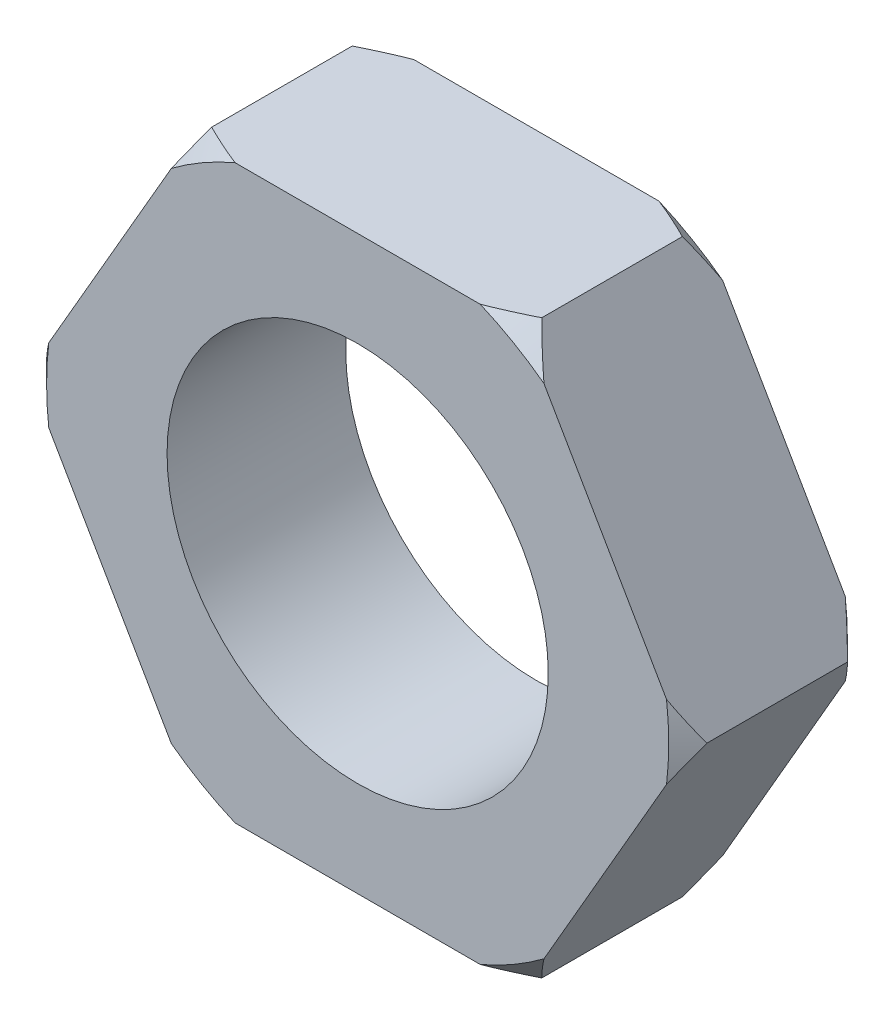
ISO-10303-21;
HEADER;
FILE_DESCRIPTION(('STEP AP214'),'2;1');
FILE_NAME('part.step','',(''),(''),'','','');
FILE_SCHEMA(('AUTOMOTIVE_DESIGN { 1 0 10303 214 1 1 1 1 }'));
ENDSEC;
DATA;
#1=APPLICATION_CONTEXT('core data for automotive mechanical design processes');
#2=APPLICATION_PROTOCOL_DEFINITION('international standard','automotive_design',2000,#1);
#3=PRODUCT_CONTEXT('',#1,'mechanical');
#4=PRODUCT('Part','Part','',(#3));
#5=PRODUCT_RELATED_PRODUCT_CATEGORY('part','',(#4));
#6=PRODUCT_DEFINITION_FORMATION('','',#4);
#7=PRODUCT_DEFINITION_CONTEXT('part definition',#1,'design');
#8=PRODUCT_DEFINITION('design','',#6,#7);
#9=PRODUCT_DEFINITION_SHAPE('','',#8);
#10=(LENGTH_UNIT() NAMED_UNIT(*) SI_UNIT(.MILLI.,.METRE.));
#11=(NAMED_UNIT(*) PLANE_ANGLE_UNIT() SI_UNIT($,.RADIAN.));
#12=(NAMED_UNIT(*) SI_UNIT($,.STERADIAN.) SOLID_ANGLE_UNIT());
#13=UNCERTAINTY_MEASURE_WITH_UNIT(LENGTH_MEASURE(1.E-05),#10,'distance_accuracy_value','');
#14=(GEOMETRIC_REPRESENTATION_CONTEXT(3) GLOBAL_UNCERTAINTY_ASSIGNED_CONTEXT((#13)) GLOBAL_UNIT_ASSIGNED_CONTEXT((#10,
#11,#12)) REPRESENTATION_CONTEXT('',''));
#15=CARTESIAN_POINT('',(0.,0.,0.));
#16=DIRECTION('',(0.,0.,1.));
#17=DIRECTION('',(1.,0.,0.));
#18=AXIS2_PLACEMENT_3D('',#15,#16,#17);
#19=CARTESIAN_POINT('',(6.92820323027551,12.,-7.5));
#20=DIRECTION('',(0.,1.,0.));
#21=DIRECTION('',(0.,0.,1.));
#22=AXIS2_PLACEMENT_3D('',#19,#20,#21);
#23=PLANE('',#22);
#24=CARTESIAN_POINT('',(-0.329616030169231,12.,1.05188036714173));
#25=CARTESIAN_POINT('',(-0.517661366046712,12.,1.04673909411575));
#26=CARTESIAN_POINT('',(-0.705573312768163,12.,1.0371428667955));
#27=CARTESIAN_POINT('',(-1.08071792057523,12.,1.0092861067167));
#28=CARTESIAN_POINT('',(-1.26795070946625,12.,0.99102729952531));
#29=CARTESIAN_POINT('',(-1.64111367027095,12.,0.946123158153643));
#30=CARTESIAN_POINT('',(-1.82704539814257,12.,0.919490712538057));
#31=CARTESIAN_POINT('',(-2.19757769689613,12.,0.858211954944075));
#32=CARTESIAN_POINT('',(-2.3821782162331,12.,0.823565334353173));
#33=CARTESIAN_POINT('',(-2.92963006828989,12.,0.70908273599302));
#34=CARTESIAN_POINT('',(-3.29020675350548,12.,0.618195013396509));
#35=CARTESIAN_POINT('',(-4.00377556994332,12.,0.410715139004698));
#36=CARTESIAN_POINT('',(-4.35676765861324,12.,0.294122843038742));
#37=CARTESIAN_POINT('',(-4.8098025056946,12.,0.128730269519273));
#38=CARTESIAN_POINT('',(-4.91352664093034,12.,0.0897707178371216));
#39=CARTESIAN_POINT('',(-5.12037499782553,12.,0.00998428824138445));
#40=CARTESIAN_POINT('',(-5.22349851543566,12.,-0.0308444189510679));
#41=CARTESIAN_POINT('',(-5.76598504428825,12.,-0.250920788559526));
#42=CARTESIAN_POINT('',(-6.19933830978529,12.,-0.445147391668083));
#43=CARTESIAN_POINT('',(-7.0541536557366,12.,-0.858367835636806));
#44=CARTESIAN_POINT('',(-7.47560879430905,12.,-1.07737577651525));
#45=CARTESIAN_POINT('',(-8.30917616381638,12.,-1.53539981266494));
#46=CARTESIAN_POINT('',(-8.72125467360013,12.,-1.77447692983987));
#47=CARTESIAN_POINT('',(-9.53605768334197,12.,-2.26780017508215));
#48=CARTESIAN_POINT('',(-9.93878397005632,12.,-2.52204337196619));
#49=CARTESIAN_POINT('',(-10.7308448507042,12.,-3.03900575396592));
#50=CARTESIAN_POINT('',(-11.1202874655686,12.,-3.30156015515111));
#51=CARTESIAN_POINT('',(-11.8926572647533,12.,-3.83612504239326));
#52=CARTESIAN_POINT('',(-12.2755838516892,12.,-4.10813638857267));
#53=CARTESIAN_POINT('',(-13.0328997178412,12.,-4.65768793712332));
#54=CARTESIAN_POINT('',(-13.4073322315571,12.,-4.93516869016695));
#55=CARTESIAN_POINT('',(-13.9653999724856,12.,-5.35602175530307));
#56=CARTESIAN_POINT('',(-14.150802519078,12.,-5.49705999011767));
#57=CARTESIAN_POINT('',(-14.5205127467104,12.,-5.78055793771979));
#58=CARTESIAN_POINT('',(-14.7048204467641,12.,-5.92301762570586));
#59=CARTESIAN_POINT('',(-14.8886252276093,12.,-6.06612373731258));
#60=B_SPLINE_CURVE_WITH_KNOTS('',3,(#24,#25,#26,#27,#28,#29,#30,#31,#32,#33,#34,#35,#36,#37,#38,
#39,#40,#41,#42,#43,#44,#45,#46,#47,#48,#49,#50,#51,#52,#53,#54,#55,#56,#57,#58,#59),
.UNSPECIFIED.,.F.,.F.,(4,2,2,2,2,2,2,2,2,2,2,2,2,2,2,2,2,4),(0.,0.564276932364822,
1.12844150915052,1.69174194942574,2.25506408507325,3.36942770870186,4.48379758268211,
4.81618698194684,5.14890894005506,6.57240245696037,7.99671002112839,9.4255171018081,
10.8540489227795,12.2629226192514,13.6719247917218,15.0699691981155,15.7688148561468,
16.4676483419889),.UNSPECIFIED.);
#61=CARTESIAN_POINT('',(-5.14487605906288,12.,0.));
#62=VERTEX_POINT('',#61);
#63=CARTESIAN_POINT('',(-6.92820323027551,12.,-0.8));
#64=VERTEX_POINT('',#63);
#65=EDGE_CURVE('E158',#62,#64,#60,.T.);
#66=ORIENTED_EDGE('',*,*,#65,.F.);
#67=DIRECTION('',(-1.,0.,0.));
#68=VECTOR('',#67,1.);
#69=CARTESIAN_POINT('',(6.92820323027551,12.,0.));
#70=LINE('',#69,#68);
#71=CARTESIAN_POINT('',(5.14487605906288,12.,0.));
#72=VERTEX_POINT('',#71);
#73=EDGE_CURVE('E370',#72,#62,#70,.T.);
#74=ORIENTED_EDGE('',*,*,#73,.F.);
#75=CARTESIAN_POINT('',(14.8886252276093,12.,-6.06612373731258));
#76=CARTESIAN_POINT('',(14.6996404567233,12.,-5.91898482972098));
#77=CARTESIAN_POINT('',(14.5101241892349,12.,-5.77252909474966));
#78=CARTESIAN_POINT('',(14.1299314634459,12.,-5.48112407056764));
#79=CARTESIAN_POINT('',(13.9392549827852,12.,-5.33617481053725));
#80=CARTESIAN_POINT('',(13.3652432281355,12.,-4.90372465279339));
#81=CARTESIAN_POINT('',(12.9800314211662,12.,-4.61870397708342));
#82=CARTESIAN_POINT('',(12.2007600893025,12.,-4.0545759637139));
#83=CARTESIAN_POINT('',(11.8066552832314,12.,-3.77553103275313));
#84=CARTESIAN_POINT('',(11.0114659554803,12.,-3.22761378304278));
#85=CARTESIAN_POINT('',(10.6103821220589,12.,-2.95874046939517));
#86=CARTESIAN_POINT('',(9.81666071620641,12.,-2.44453643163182));
#87=CARTESIAN_POINT('',(9.42435726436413,12.,-2.19869207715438));
#88=CARTESIAN_POINT('',(8.63082004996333,12.,-1.72163382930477));
#89=CARTESIAN_POINT('',(8.22958495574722,12.,-1.49042213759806));
#90=CARTESIAN_POINT('',(7.41797649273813,12.,-1.04717817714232));
#91=CARTESIAN_POINT('',(7.00763040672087,12.,-0.835096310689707));
#92=CARTESIAN_POINT('',(6.17564968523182,12.,-0.434546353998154));
#93=CARTESIAN_POINT('',(5.75401986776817,12.,-0.246068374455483));
#94=CARTESIAN_POINT('',(4.93227158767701,12.,0.0873022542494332));
#95=CARTESIAN_POINT('',(4.53307986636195,12.,0.234460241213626));
#96=CARTESIAN_POINT('',(3.72459547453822,12.,0.497470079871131));
#97=CARTESIAN_POINT('',(3.31531017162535,12.,0.613344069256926));
#98=CARTESIAN_POINT('',(2.6912050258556,12.,0.760039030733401));
#99=CARTESIAN_POINT('',(2.47958658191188,12.,0.804684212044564));
#100=CARTESIAN_POINT('',(2.05442145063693,12.,0.883607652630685));
#101=CARTESIAN_POINT('',(1.84087491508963,12.,0.917886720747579));
#102=CARTESIAN_POINT('',(1.41158076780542,12.,0.975544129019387));
#103=CARTESIAN_POINT('',(1.19582818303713,12.,0.998885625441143));
#104=CARTESIAN_POINT('',(0.763317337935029,12.,1.03409650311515));
#105=CARTESIAN_POINT('',(0.546558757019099,12.,1.04596193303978));
#106=CARTESIAN_POINT('',(0.329616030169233,12.,1.05188036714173));
#107=B_SPLINE_CURVE_WITH_KNOTS('',3,(#75,#76,#77,#78,#79,#80,#81,#82,#83,#84,#85,#86,#87,#88,
#89,#90,#91,#92,#93,#94,#95,#96,#97,#98,#99,#100,#101,#102,#103,#104,#105,#106),.UNSPECIFIED.,
.F.,.F.,(4,2,2,2,2,2,2,2,2,2,2,2,2,2,2,4),(0.,0.718527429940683,1.43706875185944,
2.87455397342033,4.32310435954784,5.77151269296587,7.16017067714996,8.54903710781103,
9.93419240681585,11.31876541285,12.5941185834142,13.8685668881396,14.5171810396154,
15.1657445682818,15.8164773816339,16.4674341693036),.UNSPECIFIED.);
#108=CARTESIAN_POINT('',(6.92820323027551,12.,-0.8));
#109=VERTEX_POINT('',#108);
#110=EDGE_CURVE('E334',#109,#72,#107,.T.);
#111=ORIENTED_EDGE('',*,*,#110,.F.);
#112=DIRECTION('',(0.,0.,1.));
#113=VECTOR('',#112,1.);
#114=CARTESIAN_POINT('',(6.92820323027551,12.,-7.5));
#115=LINE('',#114,#113);
#116=CARTESIAN_POINT('',(6.92820323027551,12.,-6.7));
#117=VERTEX_POINT('',#116);
#118=EDGE_CURVE('E188',#117,#109,#115,.T.);
#119=ORIENTED_EDGE('',*,*,#118,.F.);
#120=CARTESIAN_POINT('',(0.329616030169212,12.,-8.55188036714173));
#121=CARTESIAN_POINT('',(0.517661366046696,12.,-8.54673909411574));
#122=CARTESIAN_POINT('',(0.705573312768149,12.,-8.53714286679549));
#123=CARTESIAN_POINT('',(1.08071792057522,12.,-8.5092861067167));
#124=CARTESIAN_POINT('',(1.26795070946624,12.,-8.4910272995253));
#125=CARTESIAN_POINT('',(1.64111367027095,12.,-8.44612315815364));
#126=CARTESIAN_POINT('',(1.82704539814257,12.,-8.41949071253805));
#127=CARTESIAN_POINT('',(2.19757769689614,12.,-8.35821195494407));
#128=CARTESIAN_POINT('',(2.38217821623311,12.,-8.32356533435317));
#129=CARTESIAN_POINT('',(2.92963006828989,12.,-8.20908273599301));
#130=CARTESIAN_POINT('',(3.29020675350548,12.,-8.11819501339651));
#131=CARTESIAN_POINT('',(4.00377556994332,12.,-7.9107151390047));
#132=CARTESIAN_POINT('',(4.35676765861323,12.,-7.79412284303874));
#133=CARTESIAN_POINT('',(4.80980250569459,12.,-7.62873026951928));
#134=CARTESIAN_POINT('',(4.91352664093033,12.,-7.58977071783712));
#135=CARTESIAN_POINT('',(5.12037499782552,12.,-7.50998428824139));
#136=CARTESIAN_POINT('',(5.22349851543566,12.,-7.46915558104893));
#137=CARTESIAN_POINT('',(5.76598504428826,12.,-7.24907921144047));
#138=CARTESIAN_POINT('',(6.19933830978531,12.,-7.05485260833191));
#139=CARTESIAN_POINT('',(7.05415365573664,12.,-6.64163216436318));
#140=CARTESIAN_POINT('',(7.4756087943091,12.,-6.42262422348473));
#141=CARTESIAN_POINT('',(8.30917616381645,12.,-5.96460018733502));
#142=CARTESIAN_POINT('',(8.72125467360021,12.,-5.72552307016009));
#143=CARTESIAN_POINT('',(9.53605768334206,12.,-5.2321998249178));
#144=CARTESIAN_POINT('',(9.93878397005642,12.,-4.97795662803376));
#145=CARTESIAN_POINT('',(10.7308448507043,12.,-4.46099424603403));
#146=CARTESIAN_POINT('',(11.1202874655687,12.,-4.19843984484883));
#147=CARTESIAN_POINT('',(11.8926572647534,12.,-3.6638749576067));
#148=CARTESIAN_POINT('',(12.2755838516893,12.,-3.3918636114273));
#149=CARTESIAN_POINT('',(13.0328997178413,12.,-2.84231206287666));
#150=CARTESIAN_POINT('',(13.4073322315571,12.,-2.56483130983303));
#151=CARTESIAN_POINT('',(13.9653999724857,12.,-2.14397824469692));
#152=CARTESIAN_POINT('',(14.150802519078,12.,-2.00294000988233));
#153=CARTESIAN_POINT('',(14.5205127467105,12.,-1.71944206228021));
#154=CARTESIAN_POINT('',(14.7048204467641,12.,-1.57698237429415));
#155=CARTESIAN_POINT('',(14.8886252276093,12.,-1.43387626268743));
#156=B_SPLINE_CURVE_WITH_KNOTS('',3,(#120,#121,#122,#123,#124,#125,#126,#127,#128,#129,#130,
#131,#132,#133,#134,#135,#136,#137,#138,#139,#140,#141,#142,#143,#144,#145,#146,#147,#148,#149,
#150,#151,#152,#153,#154,#155),.UNSPECIFIED.,.F.,.F.,(4,2,2,2,2,2,2,2,2,2,2,2,2,2,2,2,2,4),(0.,
0.564276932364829,1.12844150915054,1.69174194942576,2.25506408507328,3.36942770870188,
4.48379758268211,4.81618698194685,5.14890894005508,6.57240245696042,7.99671002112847,
9.42551710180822,10.8540489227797,12.2629226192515,13.6719247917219,15.0699691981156,
15.7688148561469,16.467648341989),.UNSPECIFIED.);
#157=CARTESIAN_POINT('',(5.14487605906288,12.,-7.5));
#158=VERTEX_POINT('',#157);
#159=EDGE_CURVE('E225',#158,#117,#156,.T.);
#160=ORIENTED_EDGE('',*,*,#159,.F.);
#161=DIRECTION('',(-1.,0.,0.));
#162=VECTOR('',#161,1.);
#163=CARTESIAN_POINT('',(6.92820323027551,12.,-7.5));
#164=LINE('',#163,#162);
#165=CARTESIAN_POINT('',(-5.14487605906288,12.,-7.5));
#166=VERTEX_POINT('',#165);
#167=EDGE_CURVE('E214',#158,#166,#164,.T.);
#168=ORIENTED_EDGE('',*,*,#167,.T.);
#169=CARTESIAN_POINT('',(-14.8886252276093,12.,-1.43387626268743));
#170=CARTESIAN_POINT('',(-14.6996404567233,12.,-1.58101517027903));
#171=CARTESIAN_POINT('',(-14.5101241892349,12.,-1.72747090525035));
#172=CARTESIAN_POINT('',(-14.1299314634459,12.,-2.01887592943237));
#173=CARTESIAN_POINT('',(-13.9392549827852,12.,-2.16382518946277));
#174=CARTESIAN_POINT('',(-13.3652432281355,12.,-2.59627534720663));
#175=CARTESIAN_POINT('',(-12.9800314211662,12.,-2.8812960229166));
#176=CARTESIAN_POINT('',(-12.2007600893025,12.,-3.44542403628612));
#177=CARTESIAN_POINT('',(-11.8066552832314,12.,-3.72446896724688));
#178=CARTESIAN_POINT('',(-11.0114659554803,12.,-4.27238621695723));
#179=CARTESIAN_POINT('',(-10.6103821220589,12.,-4.54125953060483));
#180=CARTESIAN_POINT('',(-9.81666071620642,12.,-5.05546356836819));
#181=CARTESIAN_POINT('',(-9.42435726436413,12.,-5.30130792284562));
#182=CARTESIAN_POINT('',(-8.63082004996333,12.,-5.77836617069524));
#183=CARTESIAN_POINT('',(-8.22958495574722,12.,-6.00957786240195));
#184=CARTESIAN_POINT('',(-7.41797649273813,12.,-6.45282182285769));
#185=CARTESIAN_POINT('',(-7.00763040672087,12.,-6.6649036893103));
#186=CARTESIAN_POINT('',(-6.17564968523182,12.,-7.06545364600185));
#187=CARTESIAN_POINT('',(-5.75401986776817,12.,-7.25393162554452));
#188=CARTESIAN_POINT('',(-4.93227158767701,12.,-7.58730225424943));
#189=CARTESIAN_POINT('',(-4.53307986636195,12.,-7.73446024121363));
#190=CARTESIAN_POINT('',(-3.72459547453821,12.,-7.99747007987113));
#191=CARTESIAN_POINT('',(-3.31531017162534,12.,-8.11334406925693));
#192=CARTESIAN_POINT('',(-2.69120502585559,12.,-8.2600390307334));
#193=CARTESIAN_POINT('',(-2.47958658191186,12.,-8.30468421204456));
#194=CARTESIAN_POINT('',(-2.05442145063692,12.,-8.38360765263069));
#195=CARTESIAN_POINT('',(-1.84087491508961,12.,-8.41788672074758));
#196=CARTESIAN_POINT('',(-1.4115807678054,12.,-8.47554412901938));
#197=CARTESIAN_POINT('',(-1.19582818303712,12.,-8.49888562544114));
#198=CARTESIAN_POINT('',(-0.76331733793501,12.,-8.53409650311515));
#199=CARTESIAN_POINT('',(-0.546558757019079,12.,-8.54596193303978));
#200=CARTESIAN_POINT('',(-0.329616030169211,12.,-8.55188036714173));
#201=B_SPLINE_CURVE_WITH_KNOTS('',3,(#169,#170,#171,#172,#173,#174,#175,#176,#177,#178,#179,
#180,#181,#182,#183,#184,#185,#186,#187,#188,#189,#190,#191,#192,#193,#194,#195,#196,#197,#198,
#199,#200),.UNSPECIFIED.,.F.,.F.,(4,2,2,2,2,2,2,2,2,2,2,2,2,2,2,4),(0.,0.718527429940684,
1.43706875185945,2.87455397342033,4.32310435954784,5.77151269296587,7.16017067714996,
8.54903710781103,9.93419240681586,11.31876541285,12.5941185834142,13.8685668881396,
14.5171810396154,15.1657445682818,15.816477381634,16.4674341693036),.UNSPECIFIED.);
#202=CARTESIAN_POINT('',(-6.92820323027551,12.,-6.7));
#203=VERTEX_POINT('',#202);
#204=EDGE_CURVE('E222',#203,#166,#201,.T.);
#205=ORIENTED_EDGE('',*,*,#204,.F.);
#206=DIRECTION('',(0.,0.,1.));
#207=VECTOR('',#206,1.);
#208=CARTESIAN_POINT('',(-6.92820323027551,12.,-7.5));
#209=LINE('',#208,#207);
#210=EDGE_CURVE('E176',#203,#64,#209,.T.);
#211=ORIENTED_EDGE('',*,*,#210,.T.);
#212=EDGE_LOOP('',(#66,#74,#111,#119,#160,#168,#205,#211));
#213=FACE_BOUND('',#212,.T.);
#214=ADVANCED_FACE('F24',(#213),#23,.T.);
#215=CARTESIAN_POINT('',(13.856406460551,0.,-7.5));
#216=DIRECTION('',(0.866025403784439,0.5,0.));
#217=DIRECTION('',(-0.5,0.866025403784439,0.));
#218=AXIS2_PLACEMENT_3D('',#215,#216,#217);
#219=PLANE('',#218);
#220=CARTESIAN_POINT('',(7.82012060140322,10.4551537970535,0.000200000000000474));
#221=CARTESIAN_POINT('',(7.74427296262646,10.586525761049,-0.0595727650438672));
#222=CARTESIAN_POINT('',(7.6688087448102,10.7172336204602,-0.121272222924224));
#223=CARTESIAN_POINT('',(7.51866904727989,10.9772832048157,-0.248202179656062));
#224=CARTESIAN_POINT('',(7.4439932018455,11.1066255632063,-0.313430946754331));
#225=CARTESIAN_POINT('',(7.29538189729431,11.364027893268,-0.447152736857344));
#226=CARTESIAN_POINT('',(7.22144640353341,11.4920879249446,-0.515645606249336));
#227=CARTESIAN_POINT('',(7.07425414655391,11.7470323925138,-0.655671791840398));
#228=CARTESIAN_POINT('',(7.00099773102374,11.8739162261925,-0.727206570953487));
#229=CARTESIAN_POINT('',(6.92808776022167,12.0002,-0.800115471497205));
#230=B_SPLINE_CURVE_WITH_KNOTS('',3,(#220,#221,#222,#223,#224,#225,#226,#227,#228,#229),
.UNSPECIFIED.,.F.,.F.,(4,2,2,2,4),(0.,0.48911680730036,0.977995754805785,1.46685171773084,
1.95594550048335),.UNSPECIFIED.);
#231=CARTESIAN_POINT('',(7.81986681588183,10.4555933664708,0.));
#232=VERTEX_POINT('',#231);
#233=EDGE_CURVE('E330',#232,#109,#230,.T.);
#234=ORIENTED_EDGE('',*,*,#233,.F.);
#235=DIRECTION('',(-0.5,0.866025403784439,0.));
#236=VECTOR('',#235,1.);
#237=CARTESIAN_POINT('',(13.856406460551,0.,0.));
#238=LINE('',#237,#236);
#239=CARTESIAN_POINT('',(12.9647428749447,1.54440663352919,0.));
#240=VERTEX_POINT('',#239);
#241=EDGE_CURVE('E226',#240,#232,#238,.T.);
#242=ORIENTED_EDGE('',*,*,#241,.F.);
#243=CARTESIAN_POINT('',(13.8565219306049,-0.000199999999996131,-0.800115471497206));
#244=CARTESIAN_POINT('',(13.7836119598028,0.126083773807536,-0.727206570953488));
#245=CARTESIAN_POINT('',(13.7103555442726,0.252967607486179,-0.655671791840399));
#246=CARTESIAN_POINT('',(13.5631632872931,0.507912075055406,-0.515645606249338));
#247=CARTESIAN_POINT('',(13.4892277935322,0.635972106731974,-0.447152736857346));
#248=CARTESIAN_POINT('',(13.340616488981,0.893374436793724,-0.313430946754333));
#249=CARTESIAN_POINT('',(13.2659406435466,1.02271679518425,-0.248202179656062));
#250=CARTESIAN_POINT('',(13.1158009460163,1.28276637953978,-0.121272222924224));
#251=CARTESIAN_POINT('',(13.0403367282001,1.41347423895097,-0.0595727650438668));
#252=CARTESIAN_POINT('',(12.9644890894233,1.54484620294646,0.000199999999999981));
#253=B_SPLINE_CURVE_WITH_KNOTS('',3,(#243,#244,#245,#246,#247,#248,#249,#250,#251,#252),
.UNSPECIFIED.,.F.,.F.,(4,2,2,2,4),(0.,0.489093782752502,0.977949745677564,1.46682869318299,
1.95594550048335),.UNSPECIFIED.);
#254=CARTESIAN_POINT('',(13.856406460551,0.,-0.8));
#255=VERTEX_POINT('',#254);
#256=EDGE_CURVE('E40',#255,#240,#253,.T.);
#257=ORIENTED_EDGE('',*,*,#256,.F.);
#258=DIRECTION('',(0.,0.,1.));
#259=VECTOR('',#258,1.);
#260=CARTESIAN_POINT('',(13.856406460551,0.,-7.5));
#261=LINE('',#260,#259);
#262=CARTESIAN_POINT('',(13.856406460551,0.,-6.7));
#263=VERTEX_POINT('',#262);
#264=EDGE_CURVE('E197',#263,#255,#261,.T.);
#265=ORIENTED_EDGE('',*,*,#264,.F.);
#266=CARTESIAN_POINT('',(12.9644890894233,1.54484620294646,-7.5002));
#267=CARTESIAN_POINT('',(13.0403367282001,1.41347423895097,-7.44042723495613));
#268=CARTESIAN_POINT('',(13.1158009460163,1.28276637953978,-7.37872777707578));
#269=CARTESIAN_POINT('',(13.2659406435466,1.02271679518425,-7.25179782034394));
#270=CARTESIAN_POINT('',(13.340616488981,0.893374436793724,-7.18656905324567));
#271=CARTESIAN_POINT('',(13.4892277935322,0.635972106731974,-7.05284726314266));
#272=CARTESIAN_POINT('',(13.5631632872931,0.507912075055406,-6.98435439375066));
#273=CARTESIAN_POINT('',(13.7103555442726,0.25296760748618,-6.8443282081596));
#274=CARTESIAN_POINT('',(13.7836119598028,0.126083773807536,-6.77279342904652));
#275=CARTESIAN_POINT('',(13.8565219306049,-0.000199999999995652,-6.6998845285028));
#276=B_SPLINE_CURVE_WITH_KNOTS('',3,(#266,#267,#268,#269,#270,#271,#272,#273,#274,#275),
.UNSPECIFIED.,.F.,.F.,(4,2,2,2,4),(0.,0.489116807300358,0.977995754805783,1.46685171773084,
1.95594550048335),.UNSPECIFIED.);
#277=CARTESIAN_POINT('',(12.9647428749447,1.54440663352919,-7.5));
#278=VERTEX_POINT('',#277);
#279=EDGE_CURVE('E348',#278,#263,#276,.T.);
#280=ORIENTED_EDGE('',*,*,#279,.F.);
#281=DIRECTION('',(-0.5,0.866025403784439,0.));
#282=VECTOR('',#281,1.);
#283=CARTESIAN_POINT('',(13.856406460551,0.,-7.5));
#284=LINE('',#283,#282);
#285=CARTESIAN_POINT('',(7.81986681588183,10.4555933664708,-7.5));
#286=VERTEX_POINT('',#285);
#287=EDGE_CURVE('E182',#278,#286,#284,.T.);
#288=ORIENTED_EDGE('',*,*,#287,.T.);
#289=CARTESIAN_POINT('',(6.92808776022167,12.0002,-6.6998845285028));
#290=CARTESIAN_POINT('',(7.00099773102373,11.8739162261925,-6.77279342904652));
#291=CARTESIAN_POINT('',(7.07425414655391,11.7470323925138,-6.8443282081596));
#292=CARTESIAN_POINT('',(7.22144640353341,11.4920879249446,-6.98435439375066));
#293=CARTESIAN_POINT('',(7.29538189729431,11.364027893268,-7.05284726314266));
#294=CARTESIAN_POINT('',(7.44399320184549,11.1066255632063,-7.18656905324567));
#295=CARTESIAN_POINT('',(7.51866904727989,10.9772832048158,-7.25179782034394));
#296=CARTESIAN_POINT('',(7.6688087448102,10.7172336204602,-7.37872777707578));
#297=CARTESIAN_POINT('',(7.74427296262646,10.586525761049,-7.44042723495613));
#298=CARTESIAN_POINT('',(7.82012060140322,10.4551537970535,-7.5002));
#299=B_SPLINE_CURVE_WITH_KNOTS('',3,(#289,#290,#291,#292,#293,#294,#295,#296,#297,#298),
.UNSPECIFIED.,.F.,.F.,(4,2,2,2,4),(0.,0.4890937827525,0.97794974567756,1.46682869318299,
1.95594550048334),.UNSPECIFIED.);
#300=EDGE_CURVE('E355',#117,#286,#299,.T.);
#301=ORIENTED_EDGE('',*,*,#300,.F.);
#302=ORIENTED_EDGE('',*,*,#118,.T.);
#303=EDGE_LOOP('',(#234,#242,#257,#265,#280,#288,#301,#302));
#304=FACE_BOUND('',#303,.T.);
#305=ADVANCED_FACE('F339',(#304),#219,.T.);
#306=CARTESIAN_POINT('',(6.92820323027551,-12.,-7.5));
#307=DIRECTION('',(0.866025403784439,-0.5,0.));
#308=DIRECTION('',(0.5,0.866025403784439,0.));
#309=AXIS2_PLACEMENT_3D('',#306,#307,#308);
#310=PLANE('',#309);
#311=CARTESIAN_POINT('',(12.9644890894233,-1.54484620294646,0.0002));
#312=CARTESIAN_POINT('',(13.0403367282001,-1.41347423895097,-0.0595727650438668));
#313=CARTESIAN_POINT('',(13.1158009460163,-1.28276637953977,-0.121272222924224));
#314=CARTESIAN_POINT('',(13.2659406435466,-1.02271679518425,-0.248202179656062));
#315=CARTESIAN_POINT('',(13.340616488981,-0.893374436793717,-0.313430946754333));
#316=CARTESIAN_POINT('',(13.4892277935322,-0.635972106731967,-0.447152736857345));
#317=CARTESIAN_POINT('',(13.5631632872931,-0.5079120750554,-0.515645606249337));
#318=CARTESIAN_POINT('',(13.7103555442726,-0.252967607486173,-0.655671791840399));
#319=CARTESIAN_POINT('',(13.7836119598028,-0.126083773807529,-0.727206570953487));
#320=CARTESIAN_POINT('',(13.8565219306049,0.000200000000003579,-0.800115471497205));
#321=B_SPLINE_CURVE_WITH_KNOTS('',3,(#311,#312,#313,#314,#315,#316,#317,#318,#319,#320),
.UNSPECIFIED.,.F.,.F.,(4,2,2,2,4),(0.,0.489116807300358,0.977995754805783,1.46685171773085,
1.95594550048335),.UNSPECIFIED.);
#322=CARTESIAN_POINT('',(12.9647428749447,-1.54440663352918,0.));
#323=VERTEX_POINT('',#322);
#324=EDGE_CURVE('E261',#323,#255,#321,.T.);
#325=ORIENTED_EDGE('',*,*,#324,.F.);
#326=DIRECTION('',(0.5,0.866025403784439,0.));
#327=VECTOR('',#326,1.);
#328=CARTESIAN_POINT('',(6.92820323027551,-12.,0.));
#329=LINE('',#328,#327);
#330=CARTESIAN_POINT('',(7.81986681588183,-10.4555933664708,0.));
#331=VERTEX_POINT('',#330);
#332=EDGE_CURVE('E231',#331,#323,#329,.T.);
#333=ORIENTED_EDGE('',*,*,#332,.F.);
#334=CARTESIAN_POINT('',(6.92808776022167,-12.0002,-0.800115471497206));
#335=CARTESIAN_POINT('',(7.00099773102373,-11.8739162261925,-0.727206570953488));
#336=CARTESIAN_POINT('',(7.07425414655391,-11.7470323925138,-0.6556717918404));
#337=CARTESIAN_POINT('',(7.22144640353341,-11.4920879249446,-0.515645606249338));
#338=CARTESIAN_POINT('',(7.29538189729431,-11.364027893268,-0.447152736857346));
#339=CARTESIAN_POINT('',(7.4439932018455,-11.1066255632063,-0.313430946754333));
#340=CARTESIAN_POINT('',(7.51866904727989,-10.9772832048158,-0.248202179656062));
#341=CARTESIAN_POINT('',(7.6688087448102,-10.7172336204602,-0.121272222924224));
#342=CARTESIAN_POINT('',(7.74427296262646,-10.586525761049,-0.0595727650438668));
#343=CARTESIAN_POINT('',(7.82012060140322,-10.4551537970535,0.000199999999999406));
#344=B_SPLINE_CURVE_WITH_KNOTS('',3,(#334,#335,#336,#337,#338,#339,#340,#341,#342,#343),
.UNSPECIFIED.,.F.,.F.,(4,2,2,2,4),(0.,0.489093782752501,0.977949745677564,1.46682869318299,
1.95594550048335),.UNSPECIFIED.);
#345=CARTESIAN_POINT('',(6.92820323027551,-12.,-0.8));
#346=VERTEX_POINT('',#345);
#347=EDGE_CURVE('E47',#346,#331,#344,.T.);
#348=ORIENTED_EDGE('',*,*,#347,.F.);
#349=DIRECTION('',(0.,0.,1.));
#350=VECTOR('',#349,1.);
#351=CARTESIAN_POINT('',(6.92820323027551,-12.,-7.5));
#352=LINE('',#351,#350);
#353=CARTESIAN_POINT('',(6.92820323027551,-12.,-6.7));
#354=VERTEX_POINT('',#353);
#355=EDGE_CURVE('E179',#354,#346,#352,.T.);
#356=ORIENTED_EDGE('',*,*,#355,.F.);
#357=CARTESIAN_POINT('',(7.82012060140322,-10.4551537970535,-7.5002));
#358=CARTESIAN_POINT('',(7.74427296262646,-10.586525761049,-7.44042723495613));
#359=CARTESIAN_POINT('',(7.6688087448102,-10.7172336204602,-7.37872777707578));
#360=CARTESIAN_POINT('',(7.51866904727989,-10.9772832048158,-7.25179782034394));
#361=CARTESIAN_POINT('',(7.4439932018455,-11.1066255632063,-7.18656905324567));
#362=CARTESIAN_POINT('',(7.29538189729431,-11.364027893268,-7.05284726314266));
#363=CARTESIAN_POINT('',(7.22144640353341,-11.4920879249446,-6.98435439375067));
#364=CARTESIAN_POINT('',(7.07425414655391,-11.7470323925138,-6.84432820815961));
#365=CARTESIAN_POINT('',(7.00099773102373,-11.8739162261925,-6.77279342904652));
#366=CARTESIAN_POINT('',(6.92808776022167,-12.0002,-6.6998845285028));
#367=B_SPLINE_CURVE_WITH_KNOTS('',3,(#357,#358,#359,#360,#361,#362,#363,#364,#365,#366),
.UNSPECIFIED.,.F.,.F.,(4,2,2,2,4),(0.,0.489116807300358,0.977995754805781,1.46685171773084,
1.95594550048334),.UNSPECIFIED.);
#368=CARTESIAN_POINT('',(7.81986681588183,-10.4555933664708,-7.5));
#369=VERTEX_POINT('',#368);
#370=EDGE_CURVE('E258',#369,#354,#367,.T.);
#371=ORIENTED_EDGE('',*,*,#370,.F.);
#372=DIRECTION('',(0.5,0.866025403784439,0.));
#373=VECTOR('',#372,1.);
#374=CARTESIAN_POINT('',(6.92820323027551,-12.,-7.5));
#375=LINE('',#374,#373);
#376=CARTESIAN_POINT('',(12.9647428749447,-1.54440663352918,-7.5));
#377=VERTEX_POINT('',#376);
#378=EDGE_CURVE('E238',#369,#377,#375,.T.);
#379=ORIENTED_EDGE('',*,*,#378,.T.);
#380=CARTESIAN_POINT('',(13.8565219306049,0.000200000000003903,-6.6998845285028));
#381=CARTESIAN_POINT('',(13.7836119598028,-0.126083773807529,-6.77279342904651));
#382=CARTESIAN_POINT('',(13.7103555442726,-0.252967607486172,-6.8443282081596));
#383=CARTESIAN_POINT('',(13.5631632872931,-0.507912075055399,-6.98435439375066));
#384=CARTESIAN_POINT('',(13.4892277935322,-0.635972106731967,-7.05284726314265));
#385=CARTESIAN_POINT('',(13.340616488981,-0.893374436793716,-7.18656905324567));
#386=CARTESIAN_POINT('',(13.2659406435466,-1.02271679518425,-7.25179782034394));
#387=CARTESIAN_POINT('',(13.1158009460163,-1.28276637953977,-7.37872777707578));
#388=CARTESIAN_POINT('',(13.0403367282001,-1.41347423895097,-7.44042723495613));
#389=CARTESIAN_POINT('',(12.9644890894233,-1.54484620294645,-7.5002));
#390=B_SPLINE_CURVE_WITH_KNOTS('',3,(#380,#381,#382,#383,#384,#385,#386,#387,#388,#389),
.UNSPECIFIED.,.F.,.F.,(4,2,2,2,4),(0.,0.4890937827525,0.977949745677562,1.46682869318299,
1.95594550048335),.UNSPECIFIED.);
#391=EDGE_CURVE('E560',#263,#377,#390,.T.);
#392=ORIENTED_EDGE('',*,*,#391,.F.);
#393=ORIENTED_EDGE('',*,*,#264,.T.);
#394=EDGE_LOOP('',(#325,#333,#348,#356,#371,#379,#392,#393));
#395=FACE_BOUND('',#394,.T.);
#396=ADVANCED_FACE('F257',(#395),#310,.T.);
#397=CARTESIAN_POINT('',(-6.92820323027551,-12.,-7.5));
#398=DIRECTION('',(0.,-1.,0.));
#399=DIRECTION('',(1.,0.,0.));
#400=AXIS2_PLACEMENT_3D('',#397,#398,#399);
#401=PLANE('',#400);
#402=CARTESIAN_POINT('',(-14.8886252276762,-12.,-6.06612373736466));
#403=CARTESIAN_POINT('',(-14.6996404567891,-12.,-5.91898482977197));
#404=CARTESIAN_POINT('',(-14.5101241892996,-12.,-5.77252909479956));
#405=CARTESIAN_POINT('',(-14.1299314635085,-12.,-5.48112407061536));
#406=CARTESIAN_POINT('',(-13.9392549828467,-12.,-5.33617481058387));
#407=CARTESIAN_POINT('',(-13.3652432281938,-12.,-4.90372465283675));
#408=CARTESIAN_POINT('',(-12.9800314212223,-12.,-4.61870397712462));
#409=CARTESIAN_POINT('',(-12.2007600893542,-12.,-4.05457596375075));
#410=CARTESIAN_POINT('',(-11.8066552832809,-12.,-3.77553103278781));
#411=CARTESIAN_POINT('',(-11.0114659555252,-12.,-3.22761378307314));
#412=CARTESIAN_POINT('',(-10.6103821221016,-12.,-2.9587404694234));
#413=CARTESIAN_POINT('',(-9.81666071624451,-12.,-2.44453643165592));
#414=CARTESIAN_POINT('',(-9.42435726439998,-12.,-2.1986920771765));
#415=CARTESIAN_POINT('',(-8.6308200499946,-12.,-1.721633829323));
#416=CARTESIAN_POINT('',(-8.22958495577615,-12.,-1.49042213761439));
#417=CARTESIAN_POINT('',(-7.41797649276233,-12.,-1.04717817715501));
#418=CARTESIAN_POINT('',(-7.00763040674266,-12.,-0.83509631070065));
#419=CARTESIAN_POINT('',(-6.17564968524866,-12.,-0.434546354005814));
#420=CARTESIAN_POINT('',(-5.75401986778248,-12.,-0.246068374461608));
#421=CARTESIAN_POINT('',(-4.93227158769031,-12.,0.0873022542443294));
#422=CARTESIAN_POINT('',(-4.53307986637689,-12.,0.23446024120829));
#423=CARTESIAN_POINT('',(-3.7245954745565,-12.,0.497470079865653));
#424=CARTESIAN_POINT('',(-3.31531017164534,-12.,0.613344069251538));
#425=CARTESIAN_POINT('',(-2.69120502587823,-12.,0.760039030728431));
#426=CARTESIAN_POINT('',(-2.47958658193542,-12.,0.80468421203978));
#427=CARTESIAN_POINT('',(-2.05442145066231,-12.,0.883607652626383));
#428=CARTESIAN_POINT('',(-1.84087491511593,-12.,0.917886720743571));
#429=CARTESIAN_POINT('',(-1.41158076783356,-12.,0.975544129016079));
#430=CARTESIAN_POINT('',(-1.1958281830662,-12.,0.998885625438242));
#431=CARTESIAN_POINT('',(-0.763317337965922,-12.,1.03409650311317));
#432=CARTESIAN_POINT('',(-0.546558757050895,-12.,1.04596193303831));
#433=CARTESIAN_POINT('',(-0.329616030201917,-12.,1.05188036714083));
#434=B_SPLINE_CURVE_WITH_KNOTS('',3,(#402,#403,#404,#405,#406,#407,#408,#409,#410,#411,#412,
#413,#414,#415,#416,#417,#418,#419,#420,#421,#422,#423,#424,#425,#426,#427,#428,#429,#430,#431,
#432,#433),.UNSPECIFIED.,.F.,.F.,(4,2,2,2,2,2,2,2,2,2,2,2,2,2,2,4),(0.,0.718527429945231,
1.43706875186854,2.87455397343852,4.3231043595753,5.77151269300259,7.16017067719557,
8.54903710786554,9.93419240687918,11.3187654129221,12.5941185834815,13.8685668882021,
14.5171810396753,15.1657445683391,15.8164773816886,16.4674341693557),.UNSPECIFIED.);
#435=CARTESIAN_POINT('',(-6.92820323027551,-12.,-0.8));
#436=VERTEX_POINT('',#435);
#437=CARTESIAN_POINT('',(-5.14487605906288,-12.,0.));
#438=VERTEX_POINT('',#437);
#439=EDGE_CURVE('E264',#436,#438,#434,.T.);
#440=ORIENTED_EDGE('',*,*,#439,.F.);
#441=DIRECTION('',(0.,0.,1.));
#442=VECTOR('',#441,1.);
#443=CARTESIAN_POINT('',(-6.92820323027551,-12.,-7.5));
#444=LINE('',#443,#442);
#445=CARTESIAN_POINT('',(-6.9282032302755,-12.,-6.7));
#446=VERTEX_POINT('',#445);
#447=EDGE_CURVE('E175',#446,#436,#444,.T.);
#448=ORIENTED_EDGE('',*,*,#447,.F.);
#449=CARTESIAN_POINT('',(-0.329616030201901,-12.,-8.55188036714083));
#450=CARTESIAN_POINT('',(-0.517661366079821,-12.,-8.54673909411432));
#451=CARTESIAN_POINT('',(-0.705573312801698,-12.,-8.53714286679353));
#452=CARTESIAN_POINT('',(-1.08071792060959,-12.,-8.50928610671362));
#453=CARTESIAN_POINT('',(-1.267950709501,-12.,-8.49102729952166));
#454=CARTESIAN_POINT('',(-1.64111367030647,-12.,-8.44612315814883));
#455=CARTESIAN_POINT('',(-1.82704539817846,-12.,-8.41949071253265));
#456=CARTESIAN_POINT('',(-2.19757769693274,-12.,-8.35821195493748));
#457=CARTESIAN_POINT('',(-2.38217821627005,-12.,-8.32356533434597));
#458=CARTESIAN_POINT('',(-2.92963006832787,-12.,-8.20908273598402));
#459=CARTESIAN_POINT('',(-3.2902067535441,-12.,-8.11819501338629));
#460=CARTESIAN_POINT('',(-4.00377556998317,-12.,-7.91071513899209));
#461=CARTESIAN_POINT('',(-4.35676765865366,-12.,-7.79412284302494));
#462=CARTESIAN_POINT('',(-4.80980250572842,-12.,-7.62873026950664));
#463=CARTESIAN_POINT('',(-4.91352664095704,-12.,-7.58977071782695));
#464=CARTESIAN_POINT('',(-5.12037499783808,-12.,-7.50998428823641));
#465=CARTESIAN_POINT('',(-5.22349851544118,-12.,-7.46915558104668));
#466=CARTESIAN_POINT('',(-5.76598504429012,-12.,-7.24907921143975));
#467=CARTESIAN_POINT('',(-6.19933830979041,-12.,-7.05485260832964));
#468=CARTESIAN_POINT('',(-7.05415365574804,-12.,-6.64163216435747));
#469=CARTESIAN_POINT('',(-7.47560879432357,-12.,-6.42262422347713));
#470=CARTESIAN_POINT('',(-8.30917616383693,-12.,-5.96460018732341));
#471=CARTESIAN_POINT('',(-8.72125467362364,-12.,-5.72552307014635));
#472=CARTESIAN_POINT('',(-9.53605768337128,-12.,-5.23219982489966));
#473=CARTESIAN_POINT('',(-9.93878397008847,-12.,-4.97795662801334));
#474=CARTESIAN_POINT('',(-10.730844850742,-12.,-4.46099424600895));
#475=CARTESIAN_POINT('',(-11.1202874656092,-12.,-4.19843984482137));
#476=CARTESIAN_POINT('',(-11.8926572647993,-12.,-3.66387495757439));
#477=CARTESIAN_POINT('',(-12.2755838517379,-12.,-3.39186361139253));
#478=CARTESIAN_POINT('',(-13.0328997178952,-12.,-2.84231206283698));
#479=CARTESIAN_POINT('',(-13.4073322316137,-12.,-2.56483130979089));
#480=CARTESIAN_POINT('',(-13.9653999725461,-12.,-2.14397824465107));
#481=CARTESIAN_POINT('',(-14.1508025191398,-12.,-2.00294000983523));
#482=CARTESIAN_POINT('',(-14.5205127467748,-12.,-1.71944206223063));
#483=CARTESIAN_POINT('',(-14.7048204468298,-12.,-1.57698237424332));
#484=CARTESIAN_POINT('',(-14.8886252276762,-12.,-1.43387626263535));
#485=B_SPLINE_CURVE_WITH_KNOTS('',3,(#449,#450,#451,#452,#453,#454,#455,#456,#457,#458,#459,
#460,#461,#462,#463,#464,#465,#466,#467,#468,#469,#470,#471,#472,#473,#474,#475,#476,#477,#478,
#479,#480,#481,#482,#483,#484),.UNSPECIFIED.,.F.,.F.,(4,2,2,2,2,2,2,2,2,2,2,2,2,2,2,2,2,4),(0.,
0.56427693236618,1.12844150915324,1.6917419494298,2.25506408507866,3.36942770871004,
4.48379758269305,4.8161869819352,5.1489089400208,6.57240245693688,7.99671002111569,
9.42551710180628,10.8540489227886,12.2629226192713,13.6719247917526,15.069969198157,
15.7688148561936,16.467648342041),.UNSPECIFIED.);
#486=CARTESIAN_POINT('',(-5.14487605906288,-12.,-7.5));
#487=VERTEX_POINT('',#486);
#488=EDGE_CURVE('E514',#487,#446,#485,.T.);
#489=ORIENTED_EDGE('',*,*,#488,.F.);
#490=DIRECTION('',(1.,0.,0.));
#491=VECTOR('',#490,1.);
#492=CARTESIAN_POINT('',(-6.92820323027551,-12.,-7.5));
#493=LINE('',#492,#491);
#494=CARTESIAN_POINT('',(5.14487605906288,-12.,-7.5));
#495=VERTEX_POINT('',#494);
#496=EDGE_CURVE('E236',#487,#495,#493,.T.);
#497=ORIENTED_EDGE('',*,*,#496,.T.);
#498=CARTESIAN_POINT('',(14.8886252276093,-12.,-1.43387626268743));
#499=CARTESIAN_POINT('',(14.6996404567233,-12.,-1.58101517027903));
#500=CARTESIAN_POINT('',(14.5101241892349,-12.,-1.72747090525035));
#501=CARTESIAN_POINT('',(14.1299314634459,-12.,-2.01887592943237));
#502=CARTESIAN_POINT('',(13.9392549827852,-12.,-2.16382518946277));
#503=CARTESIAN_POINT('',(13.3652432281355,-12.,-2.59627534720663));
#504=CARTESIAN_POINT('',(12.9800314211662,-12.,-2.88129602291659));
#505=CARTESIAN_POINT('',(12.2007600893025,-12.,-3.44542403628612));
#506=CARTESIAN_POINT('',(11.8066552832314,-12.,-3.72446896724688));
#507=CARTESIAN_POINT('',(11.0114659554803,-12.,-4.27238621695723));
#508=CARTESIAN_POINT('',(10.6103821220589,-12.,-4.54125953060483));
#509=CARTESIAN_POINT('',(9.81666071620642,-12.,-5.05546356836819));
#510=CARTESIAN_POINT('',(9.42435726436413,-12.,-5.30130792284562));
#511=CARTESIAN_POINT('',(8.63082004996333,-12.,-5.77836617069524));
#512=CARTESIAN_POINT('',(8.22958495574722,-12.,-6.00957786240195));
#513=CARTESIAN_POINT('',(7.41797649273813,-12.,-6.45282182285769));
#514=CARTESIAN_POINT('',(7.00763040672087,-12.,-6.66490368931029));
#515=CARTESIAN_POINT('',(6.17564968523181,-12.,-7.06545364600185));
#516=CARTESIAN_POINT('',(5.75401986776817,-12.,-7.25393162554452));
#517=CARTESIAN_POINT('',(4.93227158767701,-12.,-7.58730225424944));
#518=CARTESIAN_POINT('',(4.53307986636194,-12.,-7.73446024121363));
#519=CARTESIAN_POINT('',(3.72459547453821,-12.,-7.99747007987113));
#520=CARTESIAN_POINT('',(3.31531017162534,-12.,-8.11334406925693));
#521=CARTESIAN_POINT('',(2.69120502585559,-12.,-8.2600390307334));
#522=CARTESIAN_POINT('',(2.47958658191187,-12.,-8.30468421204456));
#523=CARTESIAN_POINT('',(2.05442145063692,-12.,-8.38360765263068));
#524=CARTESIAN_POINT('',(1.84087491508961,-12.,-8.41788672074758));
#525=CARTESIAN_POINT('',(1.4115807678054,-12.,-8.47554412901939));
#526=CARTESIAN_POINT('',(1.19582818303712,-12.,-8.49888562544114));
#527=CARTESIAN_POINT('',(0.763317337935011,-12.,-8.53409650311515));
#528=CARTESIAN_POINT('',(0.54655875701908,-12.,-8.54596193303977));
#529=CARTESIAN_POINT('',(0.329616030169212,-12.,-8.55188036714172));
#530=B_SPLINE_CURVE_WITH_KNOTS('',3,(#498,#499,#500,#501,#502,#503,#504,#505,#506,#507,#508,
#509,#510,#511,#512,#513,#514,#515,#516,#517,#518,#519,#520,#521,#522,#523,#524,#525,#526,#527,
#528,#529),.UNSPECIFIED.,.F.,.F.,(4,2,2,2,2,2,2,2,2,2,2,2,2,2,2,4),(0.,0.718527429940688,
1.43706875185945,2.87455397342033,4.32310435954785,5.77151269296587,7.16017067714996,
8.54903710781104,9.93419240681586,11.31876541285,12.5941185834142,13.8685668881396,
14.5171810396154,15.1657445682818,15.816477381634,16.4674341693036),.UNSPECIFIED.);
#531=EDGE_CURVE('E253',#354,#495,#530,.T.);
#532=ORIENTED_EDGE('',*,*,#531,.F.);
#533=ORIENTED_EDGE('',*,*,#355,.T.);
#534=CARTESIAN_POINT('',(0.329616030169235,-12.,1.05188036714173));
#535=CARTESIAN_POINT('',(0.517661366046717,-12.,1.04673909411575));
#536=CARTESIAN_POINT('',(0.705573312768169,-12.,1.03714286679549));
#537=CARTESIAN_POINT('',(1.08071792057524,-12.,1.0092861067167));
#538=CARTESIAN_POINT('',(1.26795070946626,-12.,0.991027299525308));
#539=CARTESIAN_POINT('',(1.64111367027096,-12.,0.94612315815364));
#540=CARTESIAN_POINT('',(1.82704539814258,-12.,0.919490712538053));
#541=CARTESIAN_POINT('',(2.19757769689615,-12.,0.858211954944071));
#542=CARTESIAN_POINT('',(2.38217821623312,-12.,0.823565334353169));
#543=CARTESIAN_POINT('',(2.9296300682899,-12.,0.709082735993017));
#544=CARTESIAN_POINT('',(3.29020675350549,-12.,0.618195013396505));
#545=CARTESIAN_POINT('',(4.00377556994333,-12.,0.410715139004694));
#546=CARTESIAN_POINT('',(4.35676765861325,-12.,0.294122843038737));
#547=CARTESIAN_POINT('',(4.80980250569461,-12.,0.128730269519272));
#548=CARTESIAN_POINT('',(4.91352664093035,-12.,0.0897707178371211));
#549=CARTESIAN_POINT('',(5.12037499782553,-12.,0.00998428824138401));
#550=CARTESIAN_POINT('',(5.22349851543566,-12.,-0.0308444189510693));
#551=CARTESIAN_POINT('',(5.76598504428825,-12.,-0.250920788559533));
#552=CARTESIAN_POINT('',(6.19933830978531,-12.,-0.445147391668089));
#553=CARTESIAN_POINT('',(7.05415365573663,-12.,-0.858367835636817));
#554=CARTESIAN_POINT('',(7.47560879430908,-12.,-1.07737577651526));
#555=CARTESIAN_POINT('',(8.30917616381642,-12.,-1.53539981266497));
#556=CARTESIAN_POINT('',(8.72125467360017,-12.,-1.77447692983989));
#557=CARTESIAN_POINT('',(9.53605768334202,-12.,-2.26780017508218));
#558=CARTESIAN_POINT('',(9.93878397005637,-12.,-2.52204337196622));
#559=CARTESIAN_POINT('',(10.7308448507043,-12.,-3.03900575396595));
#560=CARTESIAN_POINT('',(11.1202874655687,-12.,-3.30156015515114));
#561=CARTESIAN_POINT('',(11.8926572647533,-12.,-3.83612504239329));
#562=CARTESIAN_POINT('',(12.2755838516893,-12.,-4.10813638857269));
#563=CARTESIAN_POINT('',(13.0328997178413,-12.,-4.65768793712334));
#564=CARTESIAN_POINT('',(13.4073322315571,-12.,-4.93516869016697));
#565=CARTESIAN_POINT('',(13.9653999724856,-12.,-5.35602175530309));
#566=CARTESIAN_POINT('',(14.150802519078,-12.,-5.49705999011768));
#567=CARTESIAN_POINT('',(14.5205127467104,-12.,-5.7805579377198));
#568=CARTESIAN_POINT('',(14.7048204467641,-12.,-5.92301762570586));
#569=CARTESIAN_POINT('',(14.8886252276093,-12.,-6.06612373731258));
#570=B_SPLINE_CURVE_WITH_KNOTS('',3,(#534,#535,#536,#537,#538,#539,#540,#541,#542,#543,#544,
#545,#546,#547,#548,#549,#550,#551,#552,#553,#554,#555,#556,#557,#558,#559,#560,#561,#562,#563,
#564,#565,#566,#567,#568,#569),.UNSPECIFIED.,.F.,.F.,(4,2,2,2,2,2,2,2,2,2,2,2,2,2,2,2,2,4),(0.,
0.564276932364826,1.12844150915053,1.69174194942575,2.25506408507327,3.36942770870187,
4.48379758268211,4.81618698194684,5.14890894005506,6.57240245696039,7.99671002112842,
9.42551710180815,10.8540489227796,12.2629226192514,13.6719247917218,15.0699691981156,
15.7688148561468,16.4676483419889),.UNSPECIFIED.);
#571=CARTESIAN_POINT('',(5.14487605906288,-12.,0.));
#572=VERTEX_POINT('',#571);
#573=EDGE_CURVE('E251',#572,#346,#570,.T.);
#574=ORIENTED_EDGE('',*,*,#573,.F.);
#575=DIRECTION('',(1.,0.,0.));
#576=VECTOR('',#575,1.);
#577=CARTESIAN_POINT('',(-6.92820323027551,-12.,0.));
#578=LINE('',#577,#576);
#579=EDGE_CURVE('E376',#438,#572,#578,.T.);
#580=ORIENTED_EDGE('',*,*,#579,.F.);
#581=EDGE_LOOP('',(#440,#448,#489,#497,#532,#533,#574,#580));
#582=FACE_BOUND('',#581,.T.);
#583=ADVANCED_FACE('F249',(#582),#401,.T.);
#584=CARTESIAN_POINT('',(-13.856406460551,0.,-7.5));
#585=DIRECTION('',(-0.866025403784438,-0.5,0.));
#586=DIRECTION('',(0.5,-0.866025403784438,0.));
#587=AXIS2_PLACEMENT_3D('',#584,#585,#586);
#588=PLANE('',#587);
#589=CARTESIAN_POINT('',(-7.82012060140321,-10.4551537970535,0.000199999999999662));
#590=CARTESIAN_POINT('',(-7.74427296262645,-10.586525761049,-0.0595727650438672));
#591=CARTESIAN_POINT('',(-7.6688087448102,-10.7172336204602,-0.121272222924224));
#592=CARTESIAN_POINT('',(-7.51866904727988,-10.9772832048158,-0.248202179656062));
#593=CARTESIAN_POINT('',(-7.44399320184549,-11.1066255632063,-0.313430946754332));
#594=CARTESIAN_POINT('',(-7.2953818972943,-11.364027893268,-0.447152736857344));
#595=CARTESIAN_POINT('',(-7.2214464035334,-11.4920879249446,-0.515645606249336));
#596=CARTESIAN_POINT('',(-7.0742541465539,-11.7470323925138,-0.655671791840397));
#597=CARTESIAN_POINT('',(-7.00099773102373,-11.8739162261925,-0.727206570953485));
#598=CARTESIAN_POINT('',(-6.92808776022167,-12.0002,-0.800115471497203));
#599=B_SPLINE_CURVE_WITH_KNOTS('',3,(#589,#590,#591,#592,#593,#594,#595,#596,#597,#598),
.UNSPECIFIED.,.F.,.F.,(4,2,2,2,4),(0.,0.489116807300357,0.977995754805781,1.46685171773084,
1.95594550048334),.UNSPECIFIED.);
#600=CARTESIAN_POINT('',(-7.81986681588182,-10.4555933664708,0.));
#601=VERTEX_POINT('',#600);
#602=EDGE_CURVE('E169',#601,#436,#599,.T.);
#603=ORIENTED_EDGE('',*,*,#602,.F.);
#604=DIRECTION('',(0.5,-0.866025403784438,0.));
#605=VECTOR('',#604,1.);
#606=CARTESIAN_POINT('',(-13.856406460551,0.,0.));
#607=LINE('',#606,#605);
#608=CARTESIAN_POINT('',(-12.9647428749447,-1.54440663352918,0.));
#609=VERTEX_POINT('',#608);
#610=EDGE_CURVE('E168',#609,#601,#607,.T.);
#611=ORIENTED_EDGE('',*,*,#610,.F.);
#612=CARTESIAN_POINT('',(-13.8565219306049,0.000199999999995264,-0.800115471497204));
#613=CARTESIAN_POINT('',(-13.7836119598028,-0.126083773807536,-0.727206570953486));
#614=CARTESIAN_POINT('',(-13.7103555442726,-0.252967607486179,-0.655671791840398));
#615=CARTESIAN_POINT('',(-13.5631632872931,-0.507912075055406,-0.515645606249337));
#616=CARTESIAN_POINT('',(-13.4892277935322,-0.635972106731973,-0.447152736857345));
#617=CARTESIAN_POINT('',(-13.340616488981,-0.893374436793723,-0.313430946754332));
#618=CARTESIAN_POINT('',(-13.2659406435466,-1.02271679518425,-0.248202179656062));
#619=CARTESIAN_POINT('',(-13.1158009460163,-1.28276637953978,-0.121272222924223));
#620=CARTESIAN_POINT('',(-13.0403367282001,-1.41347423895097,-0.0595727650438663));
#621=CARTESIAN_POINT('',(-12.9644890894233,-1.54484620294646,0.000200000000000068));
#622=B_SPLINE_CURVE_WITH_KNOTS('',3,(#612,#613,#614,#615,#616,#617,#618,#619,#620,#621),
.UNSPECIFIED.,.F.,.F.,(4,2,2,2,4),(0.,0.489093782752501,0.977949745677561,1.46682869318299,
1.95594550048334),.UNSPECIFIED.);
#623=CARTESIAN_POINT('',(-13.856406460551,0.,-0.8));
#624=VERTEX_POINT('',#623);
#625=EDGE_CURVE('E151',#624,#609,#622,.T.);
#626=ORIENTED_EDGE('',*,*,#625,.F.);
#627=DIRECTION('',(0.,0.,1.));
#628=VECTOR('',#627,1.);
#629=CARTESIAN_POINT('',(-13.856406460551,0.,-7.5));
#630=LINE('',#629,#628);
#631=CARTESIAN_POINT('',(-13.856406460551,0.,-6.7));
#632=VERTEX_POINT('',#631);
#633=EDGE_CURVE('E166',#632,#624,#630,.T.);
#634=ORIENTED_EDGE('',*,*,#633,.F.);
#635=CARTESIAN_POINT('',(-12.9644890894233,-1.54484620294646,-7.5002));
#636=CARTESIAN_POINT('',(-13.0403367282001,-1.41347423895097,-7.44042723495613));
#637=CARTESIAN_POINT('',(-13.1158009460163,-1.28276637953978,-7.37872777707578));
#638=CARTESIAN_POINT('',(-13.2659406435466,-1.02271679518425,-7.25179782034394));
#639=CARTESIAN_POINT('',(-13.340616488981,-0.893374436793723,-7.18656905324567));
#640=CARTESIAN_POINT('',(-13.4892277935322,-0.635972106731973,-7.05284726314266));
#641=CARTESIAN_POINT('',(-13.5631632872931,-0.507912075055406,-6.98435439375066));
#642=CARTESIAN_POINT('',(-13.7103555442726,-0.252967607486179,-6.8443282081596));
#643=CARTESIAN_POINT('',(-13.7836119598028,-0.126083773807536,-6.77279342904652));
#644=CARTESIAN_POINT('',(-13.8565219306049,0.00019999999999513,-6.6998845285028));
#645=B_SPLINE_CURVE_WITH_KNOTS('',3,(#635,#636,#637,#638,#639,#640,#641,#642,#643,#644),
.UNSPECIFIED.,.F.,.F.,(4,2,2,2,4),(0.,0.489116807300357,0.977995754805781,1.46685171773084,
1.95594550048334),.UNSPECIFIED.);
#646=CARTESIAN_POINT('',(-12.9647428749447,-1.54440663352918,-7.5));
#647=VERTEX_POINT('',#646);
#648=EDGE_CURVE('E538',#647,#632,#645,.T.);
#649=ORIENTED_EDGE('',*,*,#648,.F.);
#650=DIRECTION('',(0.5,-0.866025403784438,0.));
#651=VECTOR('',#650,1.);
#652=CARTESIAN_POINT('',(-13.856406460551,0.,-7.5));
#653=LINE('',#652,#651);
#654=CARTESIAN_POINT('',(-7.81986681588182,-10.4555933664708,-7.5));
#655=VERTEX_POINT('',#654);
#656=EDGE_CURVE('E228',#647,#655,#653,.T.);
#657=ORIENTED_EDGE('',*,*,#656,.T.);
#658=CARTESIAN_POINT('',(-6.92808776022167,-12.0002,-6.6998845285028));
#659=CARTESIAN_POINT('',(-7.00099773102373,-11.8739162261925,-6.77279342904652));
#660=CARTESIAN_POINT('',(-7.0742541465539,-11.7470323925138,-6.8443282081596));
#661=CARTESIAN_POINT('',(-7.2214464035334,-11.4920879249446,-6.98435439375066));
#662=CARTESIAN_POINT('',(-7.2953818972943,-11.364027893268,-7.05284726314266));
#663=CARTESIAN_POINT('',(-7.44399320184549,-11.1066255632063,-7.18656905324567));
#664=CARTESIAN_POINT('',(-7.51866904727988,-10.9772832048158,-7.25179782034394));
#665=CARTESIAN_POINT('',(-7.6688087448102,-10.7172336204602,-7.37872777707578));
#666=CARTESIAN_POINT('',(-7.74427296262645,-10.586525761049,-7.44042723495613));
#667=CARTESIAN_POINT('',(-7.82012060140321,-10.4551537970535,-7.5002));
#668=B_SPLINE_CURVE_WITH_KNOTS('',3,(#658,#659,#660,#661,#662,#663,#664,#665,#666,#667),
.UNSPECIFIED.,.F.,.F.,(4,2,2,2,4),(0.,0.489093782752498,0.977949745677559,1.46682869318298,
1.95594550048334),.UNSPECIFIED.);
#669=EDGE_CURVE('E512',#446,#655,#668,.T.);
#670=ORIENTED_EDGE('',*,*,#669,.F.);
#671=ORIENTED_EDGE('',*,*,#447,.T.);
#672=EDGE_LOOP('',(#603,#611,#626,#634,#649,#657,#670,#671));
#673=FACE_BOUND('',#672,.T.);
#674=ADVANCED_FACE('F164',(#673),#588,.T.);
#675=CARTESIAN_POINT('',(-6.92820323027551,12.,-7.5));
#676=DIRECTION('',(-0.866025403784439,0.5,0.));
#677=DIRECTION('',(-0.5,-0.866025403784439,0.));
#678=AXIS2_PLACEMENT_3D('',#675,#676,#677);
#679=PLANE('',#678);
#680=CARTESIAN_POINT('',(-12.9644890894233,1.54484620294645,0.000199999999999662));
#681=CARTESIAN_POINT('',(-13.0403367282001,1.41347423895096,-0.059572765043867));
#682=CARTESIAN_POINT('',(-13.1158009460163,1.28276637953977,-0.121272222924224));
#683=CARTESIAN_POINT('',(-13.2659406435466,1.02271679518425,-0.248202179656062));
#684=CARTESIAN_POINT('',(-13.340616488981,0.893374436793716,-0.313430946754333));
#685=CARTESIAN_POINT('',(-13.4892277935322,0.635972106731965,-0.447152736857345));
#686=CARTESIAN_POINT('',(-13.5631632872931,0.507912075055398,-0.515645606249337));
#687=CARTESIAN_POINT('',(-13.7103555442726,0.252967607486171,-0.655671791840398));
#688=CARTESIAN_POINT('',(-13.7836119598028,0.126083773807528,-0.727206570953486));
#689=CARTESIAN_POINT('',(-13.8565219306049,-0.000200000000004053,-0.800115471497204));
#690=B_SPLINE_CURVE_WITH_KNOTS('',3,(#680,#681,#682,#683,#684,#685,#686,#687,#688,#689),
.UNSPECIFIED.,.F.,.F.,(4,2,2,2,4),(0.,0.489116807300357,0.977995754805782,1.46685171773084,
1.95594550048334),.UNSPECIFIED.);
#691=CARTESIAN_POINT('',(-12.9647428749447,1.54440663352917,0.));
#692=VERTEX_POINT('',#691);
#693=EDGE_CURVE('E148',#692,#624,#690,.T.);
#694=ORIENTED_EDGE('',*,*,#693,.F.);
#695=DIRECTION('',(-0.5,-0.866025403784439,0.));
#696=VECTOR('',#695,1.);
#697=CARTESIAN_POINT('',(-6.92820323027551,12.,0.));
#698=LINE('',#697,#696);
#699=CARTESIAN_POINT('',(-7.81986681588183,10.4555933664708,0.));
#700=VERTEX_POINT('',#699);
#701=EDGE_CURVE('E373',#700,#692,#698,.T.);
#702=ORIENTED_EDGE('',*,*,#701,.F.);
#703=CARTESIAN_POINT('',(-6.92808776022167,12.0002,-0.800115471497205));
#704=CARTESIAN_POINT('',(-7.00099773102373,11.8739162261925,-0.727206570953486));
#705=CARTESIAN_POINT('',(-7.07425414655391,11.7470323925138,-0.655671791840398));
#706=CARTESIAN_POINT('',(-7.22144640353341,11.4920879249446,-0.515645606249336));
#707=CARTESIAN_POINT('',(-7.2953818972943,11.364027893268,-0.447152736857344));
#708=CARTESIAN_POINT('',(-7.44399320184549,11.1066255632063,-0.313430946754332));
#709=CARTESIAN_POINT('',(-7.51866904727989,10.9772832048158,-0.248202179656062));
#710=CARTESIAN_POINT('',(-7.6688087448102,10.7172336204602,-0.121272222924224));
#711=CARTESIAN_POINT('',(-7.74427296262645,10.586525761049,-0.0595727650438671));
#712=CARTESIAN_POINT('',(-7.82012060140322,10.4551537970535,0.000200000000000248));
#713=B_SPLINE_CURVE_WITH_KNOTS('',3,(#703,#704,#705,#706,#707,#708,#709,#710,#711,#712),
.UNSPECIFIED.,.F.,.F.,(4,2,2,2,4),(0.,0.489093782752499,0.977949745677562,1.46682869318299,
1.95594550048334),.UNSPECIFIED.);
#714=EDGE_CURVE('E294',#64,#700,#713,.T.);
#715=ORIENTED_EDGE('',*,*,#714,.F.);
#716=ORIENTED_EDGE('',*,*,#210,.F.);
#717=CARTESIAN_POINT('',(-7.82012060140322,10.4551537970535,-7.5002));
#718=CARTESIAN_POINT('',(-7.74427296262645,10.586525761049,-7.44042723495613));
#719=CARTESIAN_POINT('',(-7.6688087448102,10.7172336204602,-7.37872777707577));
#720=CARTESIAN_POINT('',(-7.51866904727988,10.9772832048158,-7.25179782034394));
#721=CARTESIAN_POINT('',(-7.44399320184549,11.1066255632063,-7.18656905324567));
#722=CARTESIAN_POINT('',(-7.2953818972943,11.364027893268,-7.05284726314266));
#723=CARTESIAN_POINT('',(-7.22144640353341,11.4920879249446,-6.98435439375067));
#724=CARTESIAN_POINT('',(-7.07425414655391,11.7470323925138,-6.8443282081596));
#725=CARTESIAN_POINT('',(-7.00099773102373,11.8739162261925,-6.77279342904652));
#726=CARTESIAN_POINT('',(-6.92808776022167,12.0002,-6.6998845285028));
#727=B_SPLINE_CURVE_WITH_KNOTS('',3,(#717,#718,#719,#720,#721,#722,#723,#724,#725,#726),
.UNSPECIFIED.,.F.,.F.,(4,2,2,2,4),(0.,0.489116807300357,0.97799575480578,1.46685171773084,
1.95594550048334),.UNSPECIFIED.);
#728=CARTESIAN_POINT('',(-7.81986681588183,10.4555933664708,-7.5));
#729=VERTEX_POINT('',#728);
#730=EDGE_CURVE('E544',#729,#203,#727,.T.);
#731=ORIENTED_EDGE('',*,*,#730,.F.);
#732=DIRECTION('',(-0.5,-0.866025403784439,0.));
#733=VECTOR('',#732,1.);
#734=CARTESIAN_POINT('',(-6.92820323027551,12.,-7.5));
#735=LINE('',#734,#733);
#736=CARTESIAN_POINT('',(-12.9647428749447,1.54440663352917,-7.5));
#737=VERTEX_POINT('',#736);
#738=EDGE_CURVE('E215',#729,#737,#735,.T.);
#739=ORIENTED_EDGE('',*,*,#738,.T.);
#740=CARTESIAN_POINT('',(-13.8565219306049,-0.00020000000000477,-6.6998845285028));
#741=CARTESIAN_POINT('',(-13.7836119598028,0.126083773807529,-6.77279342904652));
#742=CARTESIAN_POINT('',(-13.7103555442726,0.252967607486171,-6.8443282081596));
#743=CARTESIAN_POINT('',(-13.5631632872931,0.507912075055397,-6.98435439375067));
#744=CARTESIAN_POINT('',(-13.4892277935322,0.635972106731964,-7.05284726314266));
#745=CARTESIAN_POINT('',(-13.340616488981,0.893374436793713,-7.18656905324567));
#746=CARTESIAN_POINT('',(-13.2659406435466,1.02271679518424,-7.25179782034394));
#747=CARTESIAN_POINT('',(-13.1158009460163,1.28276637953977,-7.37872777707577));
#748=CARTESIAN_POINT('',(-13.0403367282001,1.41347423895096,-7.44042723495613));
#749=CARTESIAN_POINT('',(-12.9644890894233,1.54484620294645,-7.5002));
#750=B_SPLINE_CURVE_WITH_KNOTS('',3,(#740,#741,#742,#743,#744,#745,#746,#747,#748,#749),
.UNSPECIFIED.,.F.,.F.,(4,2,2,2,4),(0.,0.4890937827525,0.97794974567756,1.46682869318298,
1.95594550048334),.UNSPECIFIED.);
#751=EDGE_CURVE('E174',#632,#737,#750,.T.);
#752=ORIENTED_EDGE('',*,*,#751,.F.);
#753=ORIENTED_EDGE('',*,*,#633,.T.);
#754=EDGE_LOOP('',(#694,#702,#715,#716,#731,#739,#752,#753));
#755=FACE_BOUND('',#754,.T.);
#756=ADVANCED_FACE('F172',(#755),#679,.T.);
#757=CARTESIAN_POINT('',(-6.92820323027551,12.,-7.5));
#758=DIRECTION('',(0.,0.,1.));
#759=DIRECTION('',(1.,0.,0.));
#760=AXIS2_PLACEMENT_3D('',#757,#758,#759);
#761=PLANE('',#760);
#762=CARTESIAN_POINT('',(0.,0.,-7.5));
#763=DIRECTION('',(0.,0.,1.));
#764=DIRECTION('',(1.,0.,0.));
#765=AXIS2_PLACEMENT_3D('',#762,#763,#764);
#766=CIRCLE('',#765,8.);
#767=CARTESIAN_POINT('',(8.,0.,-7.5));
#768=VERTEX_POINT('',#767);
#769=EDGE_CURVE('E367',#768,#768,#766,.T.);
#770=ORIENTED_EDGE('',*,*,#769,.T.);
#771=EDGE_LOOP('',(#770));
#772=FACE_BOUND('',#771,.T.);
#773=ORIENTED_EDGE('',*,*,#378,.F.);
#774=CARTESIAN_POINT('',(0.,0.,-7.5));
#775=DIRECTION('',(0.,0.,1.));
#776=DIRECTION('',(1.,0.,0.));
#777=AXIS2_PLACEMENT_3D('',#774,#775,#776);
#778=CIRCLE('',#777,13.056406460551);
#779=EDGE_CURVE('E189',#369,#495,#778,.F.);
#780=ORIENTED_EDGE('',*,*,#779,.T.);
#781=ORIENTED_EDGE('',*,*,#496,.F.);
#782=EDGE_CURVE('E200',#487,#655,#778,.F.);
#783=ORIENTED_EDGE('',*,*,#782,.T.);
#784=ORIENTED_EDGE('',*,*,#656,.F.);
#785=EDGE_CURVE('E205',#647,#737,#778,.F.);
#786=ORIENTED_EDGE('',*,*,#785,.T.);
#787=ORIENTED_EDGE('',*,*,#738,.F.);
#788=EDGE_CURVE('E195',#729,#166,#778,.F.);
#789=ORIENTED_EDGE('',*,*,#788,.T.);
#790=ORIENTED_EDGE('',*,*,#167,.F.);
#791=EDGE_CURVE('E187',#158,#286,#778,.F.);
#792=ORIENTED_EDGE('',*,*,#791,.T.);
#793=ORIENTED_EDGE('',*,*,#287,.F.);
#794=EDGE_CURVE('E185',#278,#377,#778,.F.);
#795=ORIENTED_EDGE('',*,*,#794,.T.);
#796=EDGE_LOOP('',(#773,#780,#781,#783,#784,#786,#787,#789,#790,#792,#793,#795));
#797=FACE_BOUND('',#796,.T.);
#798=ADVANCED_FACE('F213',(#772,#797),#761,.F.);
#799=CARTESIAN_POINT('',(-6.92820323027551,12.,0.));
#800=DIRECTION('',(0.,0.,1.));
#801=DIRECTION('',(1.,0.,0.));
#802=AXIS2_PLACEMENT_3D('',#799,#800,#801);
#803=PLANE('',#802);
#804=CARTESIAN_POINT('',(0.,0.,0.));
#805=DIRECTION('',(0.,0.,1.));
#806=DIRECTION('',(1.,0.,0.));
#807=AXIS2_PLACEMENT_3D('',#804,#805,#806);
#808=CIRCLE('',#807,13.056406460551);
#809=EDGE_CURVE('E11',#331,#572,#808,.F.);
#810=ORIENTED_EDGE('',*,*,#809,.F.);
#811=ORIENTED_EDGE('',*,*,#332,.T.);
#812=EDGE_CURVE('E28',#240,#323,#808,.F.);
#813=ORIENTED_EDGE('',*,*,#812,.F.);
#814=ORIENTED_EDGE('',*,*,#241,.T.);
#815=EDGE_CURVE('E203',#72,#232,#808,.F.);
#816=ORIENTED_EDGE('',*,*,#815,.F.);
#817=ORIENTED_EDGE('',*,*,#73,.T.);
#818=EDGE_CURVE('E508',#700,#62,#808,.F.);
#819=ORIENTED_EDGE('',*,*,#818,.F.);
#820=ORIENTED_EDGE('',*,*,#701,.T.);
#821=EDGE_CURVE('E153',#609,#692,#808,.F.);
#822=ORIENTED_EDGE('',*,*,#821,.F.);
#823=ORIENTED_EDGE('',*,*,#610,.T.);
#824=EDGE_CURVE('E33',#438,#601,#808,.F.);
#825=ORIENTED_EDGE('',*,*,#824,.F.);
#826=ORIENTED_EDGE('',*,*,#579,.T.);
#827=EDGE_LOOP('',(#810,#811,#813,#814,#816,#817,#819,#820,#822,#823,#825,#826));
#828=FACE_BOUND('',#827,.T.);
#829=CARTESIAN_POINT('',(0.,0.,0.));
#830=DIRECTION('',(0.,0.,1.));
#831=DIRECTION('',(1.,0.,0.));
#832=AXIS2_PLACEMENT_3D('',#829,#830,#831);
#833=CIRCLE('',#832,8.);
#834=CARTESIAN_POINT('',(8.,0.,0.));
#835=VERTEX_POINT('',#834);
#836=EDGE_CURVE('E364',#835,#835,#833,.T.);
#837=ORIENTED_EDGE('',*,*,#836,.F.);
#838=EDGE_LOOP('',(#837));
#839=FACE_BOUND('',#838,.T.);
#840=ADVANCED_FACE('F378',(#828,#839),#803,.T.);
#841=CARTESIAN_POINT('',(0.,0.,-7.5));
#842=DIRECTION('',(0.,0.,1.));
#843=DIRECTION('',(1.,0.,0.));
#844=AXIS2_PLACEMENT_3D('',#841,#842,#843);
#845=CYLINDRICAL_SURFACE('',#844,8.);
#846=ORIENTED_EDGE('',*,*,#769,.F.);
#847=EDGE_LOOP('',(#846));
#848=FACE_BOUND('',#847,.T.);
#849=ORIENTED_EDGE('',*,*,#836,.T.);
#850=EDGE_LOOP('',(#849));
#851=FACE_BOUND('',#850,.T.);
#852=ADVANCED_FACE('F431',(#848,#851),#845,.F.);
#853=CARTESIAN_POINT('',(0.,0.,-6.7));
#854=DIRECTION('',(0.,0.,1.));
#855=DIRECTION('',(1.,0.,0.));
#856=AXIS2_PLACEMENT_3D('',#853,#854,#855);
#857=CONICAL_SURFACE('',#856,13.856406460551,0.785398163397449);
#858=ORIENTED_EDGE('',*,*,#279,.T.);
#859=ORIENTED_EDGE('',*,*,#391,.T.);
#860=ORIENTED_EDGE('',*,*,#794,.F.);
#861=EDGE_LOOP('',(#858,#859,#860));
#862=FACE_BOUND('',#861,.T.);
#863=ADVANCED_FACE('F437',(#862),#857,.T.);
#864=ORIENTED_EDGE('',*,*,#159,.T.);
#865=ORIENTED_EDGE('',*,*,#300,.T.);
#866=ORIENTED_EDGE('',*,*,#791,.F.);
#867=EDGE_LOOP('',(#864,#865,#866));
#868=FACE_BOUND('',#867,.T.);
#869=ADVANCED_FACE('F444',(#868),#857,.T.);
#870=ORIENTED_EDGE('',*,*,#204,.T.);
#871=ORIENTED_EDGE('',*,*,#788,.F.);
#872=ORIENTED_EDGE('',*,*,#730,.T.);
#873=EDGE_LOOP('',(#870,#871,#872));
#874=FACE_BOUND('',#873,.T.);
#875=ADVANCED_FACE('F451',(#874),#857,.T.);
#876=ORIENTED_EDGE('',*,*,#648,.T.);
#877=ORIENTED_EDGE('',*,*,#751,.T.);
#878=ORIENTED_EDGE('',*,*,#785,.F.);
#879=EDGE_LOOP('',(#876,#877,#878));
#880=FACE_BOUND('',#879,.T.);
#881=ADVANCED_FACE('F288',(#880),#857,.T.);
#882=ORIENTED_EDGE('',*,*,#488,.T.);
#883=ORIENTED_EDGE('',*,*,#669,.T.);
#884=ORIENTED_EDGE('',*,*,#782,.F.);
#885=EDGE_LOOP('',(#882,#883,#884));
#886=FACE_BOUND('',#885,.T.);
#887=ADVANCED_FACE('F458',(#886),#857,.T.);
#888=ORIENTED_EDGE('',*,*,#370,.T.);
#889=ORIENTED_EDGE('',*,*,#531,.T.);
#890=ORIENTED_EDGE('',*,*,#779,.F.);
#891=EDGE_LOOP('',(#888,#889,#890));
#892=FACE_BOUND('',#891,.T.);
#893=ADVANCED_FACE('F391',(#892),#857,.T.);
#894=CARTESIAN_POINT('',(0.,0.,0.));
#895=DIRECTION('',(0.,0.,-1.));
#896=DIRECTION('',(-1.,0.,0.));
#897=AXIS2_PLACEMENT_3D('',#894,#895,#896);
#898=CONICAL_SURFACE('',#897,13.056406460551,0.785398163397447);
#899=ORIENTED_EDGE('',*,*,#256,.T.);
#900=ORIENTED_EDGE('',*,*,#812,.T.);
#901=ORIENTED_EDGE('',*,*,#324,.T.);
#902=EDGE_LOOP('',(#899,#900,#901));
#903=FACE_BOUND('',#902,.T.);
#904=ADVANCED_FACE('F385',(#903),#898,.T.);
#905=ORIENTED_EDGE('',*,*,#110,.T.);
#906=ORIENTED_EDGE('',*,*,#815,.T.);
#907=ORIENTED_EDGE('',*,*,#233,.T.);
#908=EDGE_LOOP('',(#905,#906,#907));
#909=FACE_BOUND('',#908,.T.);
#910=ADVANCED_FACE('F286',(#909),#898,.T.);
#911=ORIENTED_EDGE('',*,*,#65,.T.);
#912=ORIENTED_EDGE('',*,*,#714,.T.);
#913=ORIENTED_EDGE('',*,*,#818,.T.);
#914=EDGE_LOOP('',(#911,#912,#913));
#915=FACE_BOUND('',#914,.T.);
#916=ADVANCED_FACE('F282',(#915),#898,.T.);
#917=ORIENTED_EDGE('',*,*,#625,.T.);
#918=ORIENTED_EDGE('',*,*,#821,.T.);
#919=ORIENTED_EDGE('',*,*,#693,.T.);
#920=EDGE_LOOP('',(#917,#918,#919));
#921=FACE_BOUND('',#920,.T.);
#922=ADVANCED_FACE('F150',(#921),#898,.T.);
#923=ORIENTED_EDGE('',*,*,#439,.T.);
#924=ORIENTED_EDGE('',*,*,#824,.T.);
#925=ORIENTED_EDGE('',*,*,#602,.T.);
#926=EDGE_LOOP('',(#923,#924,#925));
#927=FACE_BOUND('',#926,.T.);
#928=ADVANCED_FACE('F384',(#927),#898,.T.);
#929=ORIENTED_EDGE('',*,*,#347,.T.);
#930=ORIENTED_EDGE('',*,*,#809,.T.);
#931=ORIENTED_EDGE('',*,*,#573,.T.);
#932=EDGE_LOOP('',(#929,#930,#931));
#933=FACE_BOUND('',#932,.T.);
#934=ADVANCED_FACE('F382',(#933),#898,.T.);
#935=CLOSED_SHELL('',(#214,#305,#396,#583,#674,#756,#798,#840,#852,#863,#869,#875,#881,#887,
#893,#904,#910,#916,#922,#928,#934));
#936=MANIFOLD_SOLID_BREP('B2',#935);
#937=ADVANCED_BREP_SHAPE_REPRESENTATION('',(#18,#936),#14);
#938=SHAPE_DEFINITION_REPRESENTATION(#9,#937);
ENDSEC;
END-ISO-10303-21;
